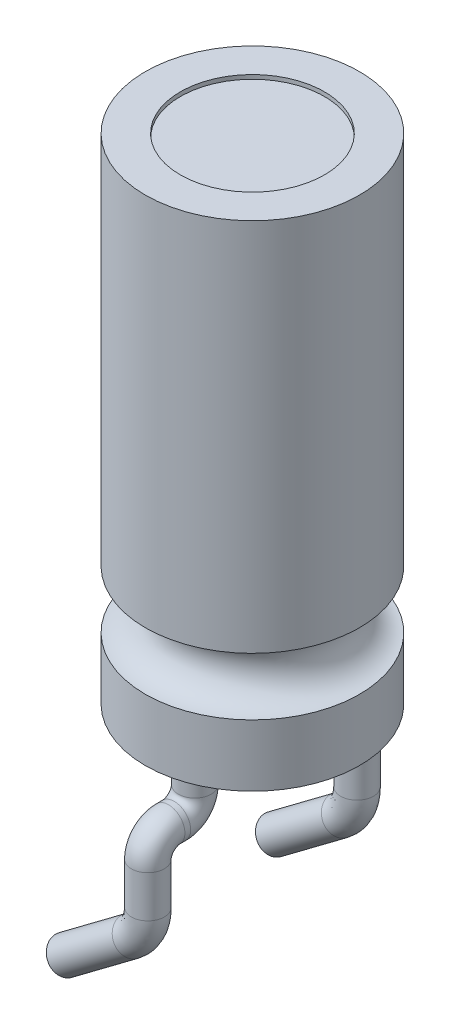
from build123d import *

# Parameters (mm, degrees)
ESQUISSE2_R             = 1.75
ENL_V_MAT_EXTRU_1_DEPTH = 0.1
ESQUISSE3_R             = 0.4
ESQUISSE5_R             = 0.4


with BuildPart() as part:
    # Esquisse1 → R_volution1 (revolve)
    with BuildSketch(Plane.XY, mode=Mode.PRIVATE) as r_volution1_sk:
        with BuildLine():
            Line((0, 39.516423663), (2.6, 39.516423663))
            Line((2.6, 39.516423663), (2.6, 30.416423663))
            ThreePointArc((2.6, 30.416423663), (1.9, 29.716423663), (2.6, 29.016423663))
            Line((2.6, 29.016423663), (2.6, 27.516423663))
            Line((2.6, 27.516423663), (0, 27.516423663))
            Line((0, 27.516423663), (0, 39.516423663))
        make_face()
    revolve(r_volution1_sk.sketch.rotate(Axis((0, 48.401709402, 0), (0, -1, 0)), 90), axis=Axis((0, 48.401709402, 0), (0, -1, 0)))

    # Esquisse2 → Enl_v. mat.-Extru.1 (cut)
    with BuildSketch(Plane(origin=(0, 39.516423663, 0), x_dir=(-1, 0, 0), z_dir=(0, 1, 0))):
        with Locations(Location((0, 0, 0), (0, 0, 90))):
            Circle(ESQUISSE2_R)
    extrude(amount=-ENL_V_MAT_EXTRU_1_DEPTH, mode=Mode.SUBTRACT)

    # Balayage1: sweep along a path in Esquisse4
    with BuildLine(Plane(origin=(0, 0, 0), x_dir=(0, 0, -1), z_dir=(1, 0, 0))) as balayage1_path:
        Line((-1.4, 27.516423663), (-1.4, 26.516423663))
        ThreePointArc((-1.4, 26.516423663), (-1.546446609, 26.162870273), (-1.9, 26.016423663))
        Line((-1.9, 26.016423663), (-2.04, 26.016423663))
        ThreePointArc((-2.04, 26.016423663), (-2.393553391, 25.869977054), (-2.54, 25.516423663))
    # Esquisse3 → Balayage1 (sweep)
    with BuildSketch(Plane.XZ.offset(-27.516423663)):
        with Locations((0, 1.4)):
            Circle(ESQUISSE3_R)
    balayage1 = sweep(path=balayage1_path.line)

    # Balayage2: sweep along a path in Esquisse6
    with BuildLine(Plane.XY.offset(2.54)) as balayage2_path:
        Line((0, 25.516423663), (0.000575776, 24.503637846))
        ThreePointArc((0.000575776, 24.503637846), (-0.104940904, 24.055967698), (-0.399678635, 23.702878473))
        Line((-0.399678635, 23.702878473), (-2.000060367, 22.503387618))
    # Esquisse5 → Balayage2 (sweep)
    with BuildSketch(Plane.XZ.offset(-25.516423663)):
        with Locations((0, 2.54)):
            Circle(ESQUISSE5_R)
    balayage2 = sweep(path=balayage2_path.line)

    # Sym_trie1: Balayage1, Balayage2 across plane
    add(balayage1.mirror(Plane.XY))
    add(balayage2.mirror(Plane.XY))


solid = part.part
